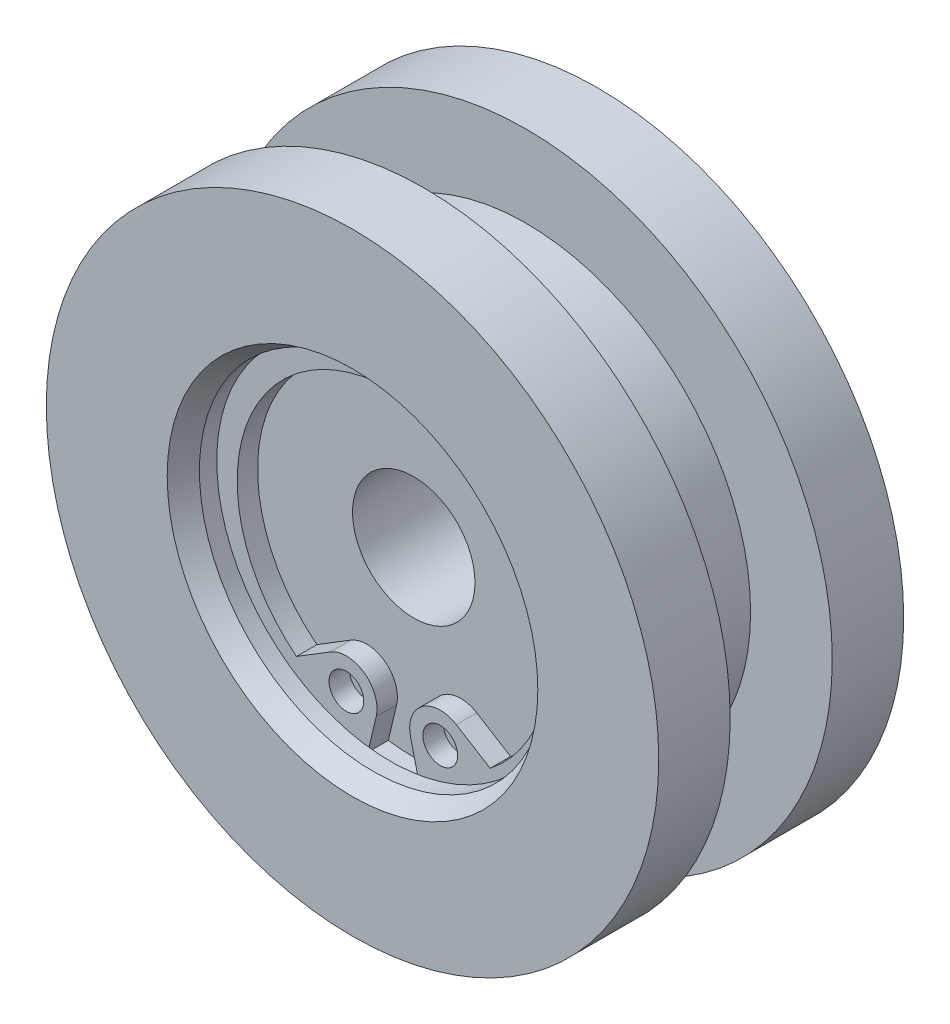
ISO-10303-21;
HEADER;
FILE_DESCRIPTION(('STEP AP214'),'2;1');
FILE_NAME('part.step','',(''),(''),'','','');
FILE_SCHEMA(('AUTOMOTIVE_DESIGN { 1 0 10303 214 1 1 1 1 }'));
ENDSEC;
DATA;
#1=APPLICATION_CONTEXT('core data for automotive mechanical design processes');
#2=APPLICATION_PROTOCOL_DEFINITION('international standard','automotive_design',2000,#1);
#3=PRODUCT_CONTEXT('',#1,'mechanical');
#4=PRODUCT('Part','Part','',(#3));
#5=PRODUCT_RELATED_PRODUCT_CATEGORY('part','',(#4));
#6=PRODUCT_DEFINITION_FORMATION('','',#4);
#7=PRODUCT_DEFINITION_CONTEXT('part definition',#1,'design');
#8=PRODUCT_DEFINITION('design','',#6,#7);
#9=PRODUCT_DEFINITION_SHAPE('','',#8);
#10=(LENGTH_UNIT() NAMED_UNIT(*) SI_UNIT(.MILLI.,.METRE.));
#11=(NAMED_UNIT(*) PLANE_ANGLE_UNIT() SI_UNIT($,.RADIAN.));
#12=(NAMED_UNIT(*) SI_UNIT($,.STERADIAN.) SOLID_ANGLE_UNIT());
#13=UNCERTAINTY_MEASURE_WITH_UNIT(LENGTH_MEASURE(1.E-05),#10,'distance_accuracy_value','');
#14=(GEOMETRIC_REPRESENTATION_CONTEXT(3) GLOBAL_UNCERTAINTY_ASSIGNED_CONTEXT((#13)) GLOBAL_UNIT_ASSIGNED_CONTEXT((#10,
#11,#12)) REPRESENTATION_CONTEXT('',''));
#15=CARTESIAN_POINT('',(0.,0.,0.));
#16=DIRECTION('',(0.,0.,1.));
#17=DIRECTION('',(1.,0.,0.));
#18=AXIS2_PLACEMENT_3D('',#15,#16,#17);
#19=CARTESIAN_POINT('',(0.,-0.5,4.));
#20=DIRECTION('',(0.,0.,1.));
#21=DIRECTION('',(-1.,0.,0.));
#22=AXIS2_PLACEMENT_3D('',#19,#20,#21);
#23=CYLINDRICAL_SURFACE('',#22,7.65);
#24=CARTESIAN_POINT('',(0.,-0.5,3.));
#25=DIRECTION('',(0.,0.,-1.));
#26=DIRECTION('',(0.,-1.,0.));
#27=AXIS2_PLACEMENT_3D('',#24,#25,#26);
#28=CIRCLE('',#27,7.65);
#29=CARTESIAN_POINT('',(-4.74513893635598,-6.50051301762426,3.));
#30=VERTEX_POINT('',#29);
#31=CARTESIAN_POINT('',(4.74513893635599,-6.50051301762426,3.));
#32=VERTEX_POINT('',#31);
#33=EDGE_CURVE('E110',#30,#32,#28,.T.);
#34=ORIENTED_EDGE('',*,*,#33,.T.);
#35=DIRECTION('',(0.,0.,-1.));
#36=VECTOR('',#35,1.);
#37=CARTESIAN_POINT('',(4.74513893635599,-6.50051301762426,4.));
#38=LINE('',#37,#36);
#39=CARTESIAN_POINT('',(4.74513893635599,-6.50051301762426,4.));
#40=VERTEX_POINT('',#39);
#41=EDGE_CURVE('E136',#40,#32,#38,.T.);
#42=ORIENTED_EDGE('',*,*,#41,.F.);
#43=CARTESIAN_POINT('',(0.,-0.5,4.));
#44=DIRECTION('',(0.,0.,-1.));
#45=DIRECTION('',(0.,-1.,0.));
#46=AXIS2_PLACEMENT_3D('',#43,#44,#45);
#47=CIRCLE('',#46,7.65);
#48=CARTESIAN_POINT('',(-4.74513893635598,-6.50051301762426,4.));
#49=VERTEX_POINT('',#48);
#50=EDGE_CURVE('E137',#49,#40,#47,.T.);
#51=ORIENTED_EDGE('',*,*,#50,.F.);
#52=DIRECTION('',(0.,0.,-1.));
#53=VECTOR('',#52,1.);
#54=CARTESIAN_POINT('',(-4.74513893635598,-6.50051301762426,4.));
#55=LINE('',#54,#53);
#56=EDGE_CURVE('E165',#49,#30,#55,.T.);
#57=ORIENTED_EDGE('',*,*,#56,.T.);
#58=EDGE_LOOP('',(#34,#42,#51,#57));
#59=FACE_BOUND('',#58,.T.);
#60=ADVANCED_FACE('F14',(#59),#23,.F.);
#61=CARTESIAN_POINT('',(3.08650226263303,-5.47917588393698,4.));
#62=DIRECTION('',(-0.524334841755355,-0.851512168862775,0.));
#63=DIRECTION('',(-0.851512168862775,0.524334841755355,0.));
#64=AXIS2_PLACEMENT_3D('',#61,#62,#63);
#65=PLANE('',#64);
#66=DIRECTION('',(-0.851512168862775,0.524334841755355,0.));
#67=VECTOR('',#66,1.);
#68=CARTESIAN_POINT('',(3.08650226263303,-5.47917588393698,3.));
#69=LINE('',#68,#67);
#70=CARTESIAN_POINT('',(3.08650226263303,-5.47917588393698,3.));
#71=VERTEX_POINT('',#70);
#72=EDGE_CURVE('E150',#32,#71,#69,.T.);
#73=ORIENTED_EDGE('',*,*,#72,.T.);
#74=DIRECTION('',(0.,0.,-1.));
#75=VECTOR('',#74,1.);
#76=CARTESIAN_POINT('',(3.08650226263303,-5.47917588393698,4.));
#77=LINE('',#76,#75);
#78=CARTESIAN_POINT('',(3.08650226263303,-5.47917588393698,4.));
#79=VERTEX_POINT('',#78);
#80=EDGE_CURVE('E145',#79,#71,#77,.T.);
#81=ORIENTED_EDGE('',*,*,#80,.F.);
#82=DIRECTION('',(-0.851512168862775,0.524334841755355,0.));
#83=VECTOR('',#82,1.);
#84=CARTESIAN_POINT('',(3.08650226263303,-5.47917588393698,4.));
#85=LINE('',#84,#83);
#86=EDGE_CURVE('E155',#40,#79,#85,.T.);
#87=ORIENTED_EDGE('',*,*,#86,.F.);
#88=ORIENTED_EDGE('',*,*,#41,.T.);
#89=EDGE_LOOP('',(#73,#81,#87,#88));
#90=FACE_BOUND('',#89,.T.);
#91=ADVANCED_FACE('F298',(#90),#65,.F.);
#92=CARTESIAN_POINT('',(2.3,-6.75644413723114,4.));
#93=DIRECTION('',(0.,0.,1.));
#94=DIRECTION('',(-1.,0.,0.));
#95=AXIS2_PLACEMENT_3D('',#92,#93,#94);
#96=CYLINDRICAL_SURFACE('',#95,1.5);
#97=CARTESIAN_POINT('',(2.3,-6.75644413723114,3.));
#98=DIRECTION('',(0.,0.,1.));
#99=DIRECTION('',(1.,0.,0.));
#100=AXIS2_PLACEMENT_3D('',#97,#98,#99);
#101=CIRCLE('',#100,1.5);
#102=CARTESIAN_POINT('',(0.840693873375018,-7.10346809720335,3.));
#103=VERTEX_POINT('',#102);
#104=EDGE_CURVE('E160',#71,#103,#101,.T.);
#105=ORIENTED_EDGE('',*,*,#104,.T.);
#106=DIRECTION('',(0.,0.,-1.));
#107=VECTOR('',#106,1.);
#108=CARTESIAN_POINT('',(0.840693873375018,-7.10346809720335,4.));
#109=LINE('',#108,#107);
#110=CARTESIAN_POINT('',(0.840693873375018,-7.10346809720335,4.));
#111=VERTEX_POINT('',#110);
#112=EDGE_CURVE('E146',#111,#103,#109,.T.);
#113=ORIENTED_EDGE('',*,*,#112,.F.);
#114=CARTESIAN_POINT('',(2.3,-6.75644413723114,4.));
#115=DIRECTION('',(0.,0.,1.));
#116=DIRECTION('',(1.,0.,0.));
#117=AXIS2_PLACEMENT_3D('',#114,#115,#116);
#118=CIRCLE('',#117,1.5);
#119=EDGE_CURVE('E151',#79,#111,#118,.T.);
#120=ORIENTED_EDGE('',*,*,#119,.F.);
#121=ORIENTED_EDGE('',*,*,#80,.T.);
#122=EDGE_LOOP('',(#105,#113,#120,#121));
#123=FACE_BOUND('',#122,.T.);
#124=ADVANCED_FACE('F244',(#123),#96,.T.);
#125=CARTESIAN_POINT('',(-0.84069387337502,-7.10346809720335,4.));
#126=DIRECTION('',(-0.97287075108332,0.231349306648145,0.));
#127=DIRECTION('',(0.,0.,1.));
#128=AXIS2_PLACEMENT_3D('',#125,#126,#127);
#129=PLANE('',#128);
#130=DIRECTION('',(0.,0.,1.));
#131=VECTOR('',#130,1.);
#132=CARTESIAN_POINT('',(-1.24703201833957,-8.81220240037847,8.6342229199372));
#133=LINE('',#132,#131);
#134=CARTESIAN_POINT('',(-1.24703201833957,-8.81220240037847,3.));
#135=VERTEX_POINT('',#134);
#136=CARTESIAN_POINT('',(-1.24703201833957,-8.81220240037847,4.));
#137=VERTEX_POINT('',#136);
#138=EDGE_CURVE('E115',#135,#137,#133,.T.);
#139=ORIENTED_EDGE('',*,*,#138,.F.);
#140=DIRECTION('',(0.231349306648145,0.97287075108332,0.));
#141=VECTOR('',#140,1.);
#142=CARTESIAN_POINT('',(-0.84069387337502,-7.10346809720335,3.));
#143=LINE('',#142,#141);
#144=CARTESIAN_POINT('',(-0.84069387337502,-7.10346809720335,3.));
#145=VERTEX_POINT('',#144);
#146=EDGE_CURVE('E103',#135,#145,#143,.T.);
#147=ORIENTED_EDGE('',*,*,#146,.T.);
#148=DIRECTION('',(0.,0.,-1.));
#149=VECTOR('',#148,1.);
#150=CARTESIAN_POINT('',(-0.84069387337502,-7.10346809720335,4.));
#151=LINE('',#150,#149);
#152=CARTESIAN_POINT('',(-0.84069387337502,-7.10346809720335,4.));
#153=VERTEX_POINT('',#152);
#154=EDGE_CURVE('E99',#153,#145,#151,.T.);
#155=ORIENTED_EDGE('',*,*,#154,.F.);
#156=DIRECTION('',(0.231349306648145,0.97287075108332,0.));
#157=VECTOR('',#156,1.);
#158=CARTESIAN_POINT('',(-0.84069387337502,-7.10346809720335,4.));
#159=LINE('',#158,#157);
#160=EDGE_CURVE('E141',#137,#153,#159,.T.);
#161=ORIENTED_EDGE('',*,*,#160,.F.);
#162=EDGE_LOOP('',(#139,#147,#155,#161));
#163=FACE_BOUND('',#162,.T.);
#164=ADVANCED_FACE('F265',(#163),#129,.F.);
#165=CARTESIAN_POINT('',(0.,-0.5,4.));
#166=DIRECTION('',(0.,0.,-1.));
#167=DIRECTION('',(0.,-1.,0.));
#168=AXIS2_PLACEMENT_3D('',#165,#166,#167);
#169=PLANE('',#168);
#170=CARTESIAN_POINT('',(2.3,-6.75644413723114,4.));
#171=DIRECTION('',(0.,0.,1.));
#172=DIRECTION('',(1.,0.,0.));
#173=AXIS2_PLACEMENT_3D('',#170,#171,#172);
#174=CIRCLE('',#173,0.85);
#175=CARTESIAN_POINT('',(3.15,-6.75644413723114,4.));
#176=VERTEX_POINT('',#175);
#177=EDGE_CURVE('E130',#176,#176,#174,.T.);
#178=ORIENTED_EDGE('',*,*,#177,.F.);
#179=EDGE_LOOP('',(#178));
#180=FACE_BOUND('',#179,.T.);
#181=CARTESIAN_POINT('',(-2.3,-6.75644413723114,4.));
#182=DIRECTION('',(0.,0.,-1.));
#183=DIRECTION('',(1.,0.,0.));
#184=AXIS2_PLACEMENT_3D('',#181,#182,#183);
#185=CIRCLE('',#184,0.85);
#186=CARTESIAN_POINT('',(-1.45,-6.75644413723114,4.));
#187=VERTEX_POINT('',#186);
#188=EDGE_CURVE('E142',#187,#187,#185,.T.);
#189=ORIENTED_EDGE('',*,*,#188,.T.);
#190=EDGE_LOOP('',(#189));
#191=FACE_BOUND('',#190,.T.);
#192=CARTESIAN_POINT('',(0.,0.,4.));
#193=DIRECTION('',(0.,0.,-1.));
#194=DIRECTION('',(-1.,0.,0.));
#195=AXIS2_PLACEMENT_3D('',#192,#193,#194);
#196=CIRCLE('',#195,8.9);
#197=CARTESIAN_POINT('',(1.24703201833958,-8.81220240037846,4.));
#198=VERTEX_POINT('',#197);
#199=EDGE_CURVE('E9',#137,#198,#196,.T.);
#200=ORIENTED_EDGE('',*,*,#199,.F.);
#201=ORIENTED_EDGE('',*,*,#160,.T.);
#202=CARTESIAN_POINT('',(-2.3,-6.75644413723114,4.));
#203=DIRECTION('',(0.,0.,1.));
#204=DIRECTION('',(-1.,0.,0.));
#205=AXIS2_PLACEMENT_3D('',#202,#203,#204);
#206=CIRCLE('',#205,1.5);
#207=CARTESIAN_POINT('',(-3.08650226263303,-5.47917588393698,4.));
#208=VERTEX_POINT('',#207);
#209=EDGE_CURVE('E138',#153,#208,#206,.T.);
#210=ORIENTED_EDGE('',*,*,#209,.T.);
#211=DIRECTION('',(-0.851512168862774,-0.524334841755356,0.));
#212=VECTOR('',#211,1.);
#213=CARTESIAN_POINT('',(-3.08650226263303,-5.47917588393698,4.));
#214=LINE('',#213,#212);
#215=EDGE_CURVE('E118',#208,#49,#214,.T.);
#216=ORIENTED_EDGE('',*,*,#215,.T.);
#217=ORIENTED_EDGE('',*,*,#50,.T.);
#218=ORIENTED_EDGE('',*,*,#86,.T.);
#219=ORIENTED_EDGE('',*,*,#119,.T.);
#220=DIRECTION('',(0.231349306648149,-0.972870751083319,0.));
#221=VECTOR('',#220,1.);
#222=CARTESIAN_POINT('',(0.840693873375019,-7.10346809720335,4.));
#223=LINE('',#222,#221);
#224=EDGE_CURVE('E156',#111,#198,#223,.T.);
#225=ORIENTED_EDGE('',*,*,#224,.T.);
#226=EDGE_LOOP('',(#200,#201,#210,#216,#217,#218,#219,#225));
#227=FACE_BOUND('',#226,.T.);
#228=ADVANCED_FACE('F261',(#180,#191,#227),#169,.F.);
#229=CARTESIAN_POINT('',(2.3,-6.75644413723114,4.));
#230=DIRECTION('',(0.,0.,1.));
#231=DIRECTION('',(-1.,0.,0.));
#232=AXIS2_PLACEMENT_3D('',#229,#230,#231);
#233=CYLINDRICAL_SURFACE('',#232,0.85);
#234=CARTESIAN_POINT('',(2.3,-6.75644413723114,3.));
#235=DIRECTION('',(0.,0.,1.));
#236=DIRECTION('',(1.,0.,0.));
#237=AXIS2_PLACEMENT_3D('',#234,#235,#236);
#238=CIRCLE('',#237,0.85);
#239=CARTESIAN_POINT('',(3.15,-6.75644413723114,3.));
#240=VERTEX_POINT('',#239);
#241=EDGE_CURVE('E120',#240,#240,#238,.T.);
#242=ORIENTED_EDGE('',*,*,#241,.F.);
#243=EDGE_LOOP('',(#242));
#244=FACE_BOUND('',#243,.T.);
#245=ORIENTED_EDGE('',*,*,#177,.T.);
#246=EDGE_LOOP('',(#245));
#247=FACE_BOUND('',#246,.T.);
#248=ADVANCED_FACE('F310',(#244,#247),#233,.F.);
#249=CARTESIAN_POINT('',(-2.3,-6.75644413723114,4.));
#250=DIRECTION('',(0.,0.,1.));
#251=DIRECTION('',(-1.,0.,0.));
#252=AXIS2_PLACEMENT_3D('',#249,#250,#251);
#253=CYLINDRICAL_SURFACE('',#252,0.85);
#254=CARTESIAN_POINT('',(-2.3,-6.75644413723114,3.));
#255=DIRECTION('',(0.,0.,-1.));
#256=DIRECTION('',(1.,0.,0.));
#257=AXIS2_PLACEMENT_3D('',#254,#255,#256);
#258=CIRCLE('',#257,0.85);
#259=CARTESIAN_POINT('',(-1.45,-6.75644413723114,3.));
#260=VERTEX_POINT('',#259);
#261=EDGE_CURVE('E133',#260,#260,#258,.T.);
#262=ORIENTED_EDGE('',*,*,#261,.T.);
#263=EDGE_LOOP('',(#262));
#264=FACE_BOUND('',#263,.T.);
#265=ORIENTED_EDGE('',*,*,#188,.F.);
#266=EDGE_LOOP('',(#265));
#267=FACE_BOUND('',#266,.T.);
#268=ADVANCED_FACE('F492',(#264,#267),#253,.F.);
#269=CARTESIAN_POINT('',(-3.08650226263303,-5.47917588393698,4.));
#270=DIRECTION('',(0.524334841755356,-0.851512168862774,0.));
#271=DIRECTION('',(0.,0.,-1.));
#272=AXIS2_PLACEMENT_3D('',#269,#270,#271);
#273=PLANE('',#272);
#274=DIRECTION('',(-0.851512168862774,-0.524334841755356,0.));
#275=VECTOR('',#274,1.);
#276=CARTESIAN_POINT('',(-3.08650226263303,-5.47917588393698,3.));
#277=LINE('',#276,#275);
#278=CARTESIAN_POINT('',(-3.08650226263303,-5.47917588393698,3.));
#279=VERTEX_POINT('',#278);
#280=EDGE_CURVE('E106',#279,#30,#277,.T.);
#281=ORIENTED_EDGE('',*,*,#280,.T.);
#282=ORIENTED_EDGE('',*,*,#56,.F.);
#283=ORIENTED_EDGE('',*,*,#215,.F.);
#284=DIRECTION('',(0.,0.,-1.));
#285=VECTOR('',#284,1.);
#286=CARTESIAN_POINT('',(-3.08650226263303,-5.47917588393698,4.));
#287=LINE('',#286,#285);
#288=EDGE_CURVE('E96',#208,#279,#287,.T.);
#289=ORIENTED_EDGE('',*,*,#288,.T.);
#290=EDGE_LOOP('',(#281,#282,#283,#289));
#291=FACE_BOUND('',#290,.T.);
#292=ADVANCED_FACE('F117',(#291),#273,.F.);
#293=CARTESIAN_POINT('',(-2.3,-6.75644413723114,4.));
#294=DIRECTION('',(0.,0.,1.));
#295=DIRECTION('',(-1.,0.,0.));
#296=AXIS2_PLACEMENT_3D('',#293,#294,#295);
#297=CYLINDRICAL_SURFACE('',#296,1.5);
#298=CARTESIAN_POINT('',(-2.3,-6.75644413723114,3.));
#299=DIRECTION('',(0.,0.,1.));
#300=DIRECTION('',(-1.,0.,0.));
#301=AXIS2_PLACEMENT_3D('',#298,#299,#300);
#302=CIRCLE('',#301,1.5);
#303=EDGE_CURVE('E91',#145,#279,#302,.T.);
#304=ORIENTED_EDGE('',*,*,#303,.T.);
#305=ORIENTED_EDGE('',*,*,#288,.F.);
#306=ORIENTED_EDGE('',*,*,#209,.F.);
#307=ORIENTED_EDGE('',*,*,#154,.T.);
#308=EDGE_LOOP('',(#304,#305,#306,#307));
#309=FACE_BOUND('',#308,.T.);
#310=ADVANCED_FACE('F93',(#309),#297,.T.);
#311=CARTESIAN_POINT('',(0.840693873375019,-7.10346809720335,4.));
#312=DIRECTION('',(0.972870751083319,0.231349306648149,0.));
#313=DIRECTION('',(0.,0.,-1.));
#314=AXIS2_PLACEMENT_3D('',#311,#312,#313);
#315=PLANE('',#314);
#316=DIRECTION('',(0.,0.,1.));
#317=VECTOR('',#316,1.);
#318=CARTESIAN_POINT('',(1.24703201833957,-8.81220240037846,8.6342229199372));
#319=LINE('',#318,#317);
#320=CARTESIAN_POINT('',(1.24703201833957,-8.81220240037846,3.));
#321=VERTEX_POINT('',#320);
#322=EDGE_CURVE('E18',#198,#321,#319,.F.);
#323=ORIENTED_EDGE('',*,*,#322,.F.);
#324=ORIENTED_EDGE('',*,*,#224,.F.);
#325=ORIENTED_EDGE('',*,*,#112,.T.);
#326=DIRECTION('',(0.231349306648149,-0.972870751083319,0.));
#327=VECTOR('',#326,1.);
#328=CARTESIAN_POINT('',(0.840693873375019,-7.10346809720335,3.));
#329=LINE('',#328,#327);
#330=EDGE_CURVE('E32',#103,#321,#329,.T.);
#331=ORIENTED_EDGE('',*,*,#330,.T.);
#332=EDGE_LOOP('',(#323,#324,#325,#331));
#333=FACE_BOUND('',#332,.T.);
#334=ADVANCED_FACE('F247',(#333),#315,.F.);
#335=CARTESIAN_POINT('',(0.,3.,3.));
#336=DIRECTION('',(0.,0.,-1.));
#337=DIRECTION('',(-1.,0.,0.));
#338=AXIS2_PLACEMENT_3D('',#335,#336,#337);
#339=PLANE('',#338);
#340=ORIENTED_EDGE('',*,*,#241,.T.);
#341=EDGE_LOOP('',(#340));
#342=FACE_BOUND('',#341,.T.);
#343=ADVANCED_FACE('F284',(#342),#339,.F.);
#344=ORIENTED_EDGE('',*,*,#261,.F.);
#345=EDGE_LOOP('',(#344));
#346=FACE_BOUND('',#345,.T.);
#347=ADVANCED_FACE('F286',(#346),#339,.F.);
#348=CARTESIAN_POINT('',(0.,0.,8.6342229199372));
#349=DIRECTION('',(0.,0.,1.));
#350=DIRECTION('',(1.,0.,0.));
#351=AXIS2_PLACEMENT_3D('',#348,#349,#350);
#352=CYLINDRICAL_SURFACE('',#351,11.);
#353=CARTESIAN_POINT('',(0.,0.,2.5));
#354=DIRECTION('',(0.,0.,1.));
#355=DIRECTION('',(1.,0.,0.));
#356=AXIS2_PLACEMENT_3D('',#353,#354,#355);
#357=CIRCLE('',#356,11.);
#358=CARTESIAN_POINT('',(11.,0.,2.5));
#359=VERTEX_POINT('',#358);
#360=EDGE_CURVE('E207',#359,#359,#357,.T.);
#361=ORIENTED_EDGE('',*,*,#360,.F.);
#362=EDGE_LOOP('',(#361));
#363=FACE_BOUND('',#362,.T.);
#364=CARTESIAN_POINT('',(0.,0.,-2.5));
#365=DIRECTION('',(0.,0.,1.));
#366=DIRECTION('',(1.,0.,0.));
#367=AXIS2_PLACEMENT_3D('',#364,#365,#366);
#368=CIRCLE('',#367,11.);
#369=CARTESIAN_POINT('',(11.,0.,-2.5));
#370=VERTEX_POINT('',#369);
#371=EDGE_CURVE('E210',#370,#370,#368,.T.);
#372=ORIENTED_EDGE('',*,*,#371,.T.);
#373=EDGE_LOOP('',(#372));
#374=FACE_BOUND('',#373,.T.);
#375=ADVANCED_FACE('F292',(#363,#374),#352,.T.);
#376=CARTESIAN_POINT('',(0.,11.,2.5));
#377=DIRECTION('',(0.,0.,1.));
#378=DIRECTION('',(1.,0.,0.));
#379=AXIS2_PLACEMENT_3D('',#376,#377,#378);
#380=PLANE('',#379);
#381=CARTESIAN_POINT('',(0.,0.,2.5));
#382=DIRECTION('',(0.,0.,1.));
#383=DIRECTION('',(1.,0.,0.));
#384=AXIS2_PLACEMENT_3D('',#381,#382,#383);
#385=CIRCLE('',#384,15.);
#386=CARTESIAN_POINT('',(15.,0.,2.5));
#387=VERTEX_POINT('',#386);
#388=EDGE_CURVE('E204',#387,#387,#385,.T.);
#389=ORIENTED_EDGE('',*,*,#388,.F.);
#390=EDGE_LOOP('',(#389));
#391=FACE_BOUND('',#390,.T.);
#392=ORIENTED_EDGE('',*,*,#360,.T.);
#393=EDGE_LOOP('',(#392));
#394=FACE_BOUND('',#393,.T.);
#395=ADVANCED_FACE('F354',(#391,#394),#380,.F.);
#396=CARTESIAN_POINT('',(0.,15.,-2.5));
#397=DIRECTION('',(0.,0.,-1.));
#398=DIRECTION('',(-1.,0.,0.));
#399=AXIS2_PLACEMENT_3D('',#396,#397,#398);
#400=PLANE('',#399);
#401=ORIENTED_EDGE('',*,*,#371,.F.);
#402=EDGE_LOOP('',(#401));
#403=FACE_BOUND('',#402,.T.);
#404=CARTESIAN_POINT('',(0.,0.,-2.5));
#405=DIRECTION('',(0.,0.,1.));
#406=DIRECTION('',(1.,0.,0.));
#407=AXIS2_PLACEMENT_3D('',#404,#405,#406);
#408=CIRCLE('',#407,15.);
#409=CARTESIAN_POINT('',(15.,0.,-2.5));
#410=VERTEX_POINT('',#409);
#411=EDGE_CURVE('E213',#410,#410,#408,.T.);
#412=ORIENTED_EDGE('',*,*,#411,.T.);
#413=EDGE_LOOP('',(#412));
#414=FACE_BOUND('',#413,.T.);
#415=ADVANCED_FACE('F352',(#403,#414),#400,.F.);
#416=CARTESIAN_POINT('',(0.,0.,8.6342229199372));
#417=DIRECTION('',(0.,0.,1.));
#418=DIRECTION('',(1.,0.,0.));
#419=AXIS2_PLACEMENT_3D('',#416,#417,#418);
#420=CYLINDRICAL_SURFACE('',#419,15.);
#421=CARTESIAN_POINT('',(0.,0.,6.));
#422=DIRECTION('',(0.,0.,1.));
#423=DIRECTION('',(1.,0.,0.));
#424=AXIS2_PLACEMENT_3D('',#421,#422,#423);
#425=CIRCLE('',#424,15.);
#426=CARTESIAN_POINT('',(15.,0.,6.));
#427=VERTEX_POINT('',#426);
#428=EDGE_CURVE('E201',#427,#427,#425,.T.);
#429=ORIENTED_EDGE('',*,*,#428,.F.);
#430=EDGE_LOOP('',(#429));
#431=FACE_BOUND('',#430,.T.);
#432=ORIENTED_EDGE('',*,*,#388,.T.);
#433=EDGE_LOOP('',(#432));
#434=FACE_BOUND('',#433,.T.);
#435=ADVANCED_FACE('F349',(#431,#434),#420,.T.);
#436=CARTESIAN_POINT('',(0.,0.,8.6342229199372));
#437=DIRECTION('',(0.,0.,1.));
#438=DIRECTION('',(1.,0.,0.));
#439=AXIS2_PLACEMENT_3D('',#436,#437,#438);
#440=CYLINDRICAL_SURFACE('',#439,15.);
#441=ORIENTED_EDGE('',*,*,#411,.F.);
#442=EDGE_LOOP('',(#441));
#443=FACE_BOUND('',#442,.T.);
#444=CARTESIAN_POINT('',(0.,0.,-6.));
#445=DIRECTION('',(0.,0.,1.));
#446=DIRECTION('',(1.,0.,0.));
#447=AXIS2_PLACEMENT_3D('',#444,#445,#446);
#448=CIRCLE('',#447,15.);
#449=CARTESIAN_POINT('',(15.,0.,-6.));
#450=VERTEX_POINT('',#449);
#451=EDGE_CURVE('E172',#450,#450,#448,.T.);
#452=ORIENTED_EDGE('',*,*,#451,.T.);
#453=EDGE_LOOP('',(#452));
#454=FACE_BOUND('',#453,.T.);
#455=ADVANCED_FACE('F16',(#443,#454),#440,.T.);
#456=CARTESIAN_POINT('',(0.,15.,6.));
#457=DIRECTION('',(0.,0.,-1.));
#458=DIRECTION('',(-1.,0.,0.));
#459=AXIS2_PLACEMENT_3D('',#456,#457,#458);
#460=PLANE('',#459);
#461=CARTESIAN_POINT('',(0.,0.,6.));
#462=DIRECTION('',(0.,0.,1.));
#463=DIRECTION('',(1.,0.,0.));
#464=AXIS2_PLACEMENT_3D('',#461,#462,#463);
#465=CIRCLE('',#464,9.07735026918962);
#466=CARTESIAN_POINT('',(9.07735026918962,0.,6.));
#467=VERTEX_POINT('',#466);
#468=EDGE_CURVE('E198',#467,#467,#465,.T.);
#469=ORIENTED_EDGE('',*,*,#468,.F.);
#470=EDGE_LOOP('',(#469));
#471=FACE_BOUND('',#470,.T.);
#472=ORIENTED_EDGE('',*,*,#428,.T.);
#473=EDGE_LOOP('',(#472));
#474=FACE_BOUND('',#473,.T.);
#475=ADVANCED_FACE('F318',(#471,#474),#460,.F.);
#476=CARTESIAN_POINT('',(0.,6.5,-6.));
#477=DIRECTION('',(0.,0.,1.));
#478=DIRECTION('',(1.,0.,0.));
#479=AXIS2_PLACEMENT_3D('',#476,#477,#478);
#480=PLANE('',#479);
#481=ORIENTED_EDGE('',*,*,#451,.F.);
#482=EDGE_LOOP('',(#481));
#483=FACE_BOUND('',#482,.T.);
#484=CARTESIAN_POINT('',(0.,0.,-6.));
#485=DIRECTION('',(0.,0.,1.));
#486=DIRECTION('',(1.,0.,0.));
#487=AXIS2_PLACEMENT_3D('',#484,#485,#486);
#488=CIRCLE('',#487,6.5);
#489=CARTESIAN_POINT('',(6.5,0.,-6.));
#490=VERTEX_POINT('',#489);
#491=EDGE_CURVE('E175',#490,#490,#488,.T.);
#492=ORIENTED_EDGE('',*,*,#491,.T.);
#493=EDGE_LOOP('',(#492));
#494=FACE_BOUND('',#493,.T.);
#495=ADVANCED_FACE('F314',(#483,#494),#480,.F.);
#496=CARTESIAN_POINT('',(0.,0.,6.));
#497=DIRECTION('',(0.,0.,1.));
#498=DIRECTION('',(1.,0.,0.));
#499=AXIS2_PLACEMENT_3D('',#496,#497,#498);
#500=CONICAL_SURFACE('',#499,9.07735026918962,0.523598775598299);
#501=CARTESIAN_POINT('',(0.,0.,5.));
#502=DIRECTION('',(0.,0.,1.));
#503=DIRECTION('',(1.,0.,0.));
#504=AXIS2_PLACEMENT_3D('',#501,#502,#503);
#505=CIRCLE('',#504,8.5);
#506=CARTESIAN_POINT('',(8.5,0.,5.));
#507=VERTEX_POINT('',#506);
#508=EDGE_CURVE('E195',#507,#507,#505,.T.);
#509=ORIENTED_EDGE('',*,*,#508,.F.);
#510=EDGE_LOOP('',(#509));
#511=FACE_BOUND('',#510,.T.);
#512=ORIENTED_EDGE('',*,*,#468,.T.);
#513=EDGE_LOOP('',(#512));
#514=FACE_BOUND('',#513,.T.);
#515=ADVANCED_FACE('F317',(#511,#514),#500,.F.);
#516=CARTESIAN_POINT('',(0.,0.,8.6342229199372));
#517=DIRECTION('',(0.,0.,1.));
#518=DIRECTION('',(1.,0.,0.));
#519=AXIS2_PLACEMENT_3D('',#516,#517,#518);
#520=CYLINDRICAL_SURFACE('',#519,6.5);
#521=ORIENTED_EDGE('',*,*,#491,.F.);
#522=EDGE_LOOP('',(#521));
#523=FACE_BOUND('',#522,.T.);
#524=CARTESIAN_POINT('',(0.,0.,-3.));
#525=DIRECTION('',(0.,0.,1.));
#526=DIRECTION('',(1.,0.,0.));
#527=AXIS2_PLACEMENT_3D('',#524,#525,#526);
#528=CIRCLE('',#527,6.5);
#529=CARTESIAN_POINT('',(6.5,0.,-3.));
#530=VERTEX_POINT('',#529);
#531=EDGE_CURVE('E178',#530,#530,#528,.T.);
#532=ORIENTED_EDGE('',*,*,#531,.T.);
#533=EDGE_LOOP('',(#532));
#534=FACE_BOUND('',#533,.T.);
#535=ADVANCED_FACE('F320',(#523,#534),#520,.F.);
#536=CARTESIAN_POINT('',(0.,0.,8.6342229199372));
#537=DIRECTION('',(0.,0.,1.));
#538=DIRECTION('',(1.,0.,0.));
#539=AXIS2_PLACEMENT_3D('',#536,#537,#538);
#540=CYLINDRICAL_SURFACE('',#539,8.5);
#541=CARTESIAN_POINT('',(0.,0.,4.15));
#542=DIRECTION('',(0.,0.,1.));
#543=DIRECTION('',(1.,0.,0.));
#544=AXIS2_PLACEMENT_3D('',#541,#542,#543);
#545=CIRCLE('',#544,8.5);
#546=CARTESIAN_POINT('',(8.5,0.,4.15));
#547=VERTEX_POINT('',#546);
#548=EDGE_CURVE('E192',#547,#547,#545,.T.);
#549=ORIENTED_EDGE('',*,*,#548,.F.);
#550=EDGE_LOOP('',(#549));
#551=FACE_BOUND('',#550,.T.);
#552=ORIENTED_EDGE('',*,*,#508,.T.);
#553=EDGE_LOOP('',(#552));
#554=FACE_BOUND('',#553,.T.);
#555=ADVANCED_FACE('F323',(#551,#554),#540,.F.);
#556=CARTESIAN_POINT('',(0.,6.5,-3.));
#557=DIRECTION('',(0.,0.,1.));
#558=DIRECTION('',(1.,0.,0.));
#559=AXIS2_PLACEMENT_3D('',#556,#557,#558);
#560=PLANE('',#559);
#561=ORIENTED_EDGE('',*,*,#531,.F.);
#562=EDGE_LOOP('',(#561));
#563=FACE_BOUND('',#562,.T.);
#564=CARTESIAN_POINT('',(0.,0.,-3.));
#565=DIRECTION('',(0.,0.,1.));
#566=DIRECTION('',(1.,0.,0.));
#567=AXIS2_PLACEMENT_3D('',#564,#565,#566);
#568=CIRCLE('',#567,3.);
#569=CARTESIAN_POINT('',(3.,0.,-3.));
#570=VERTEX_POINT('',#569);
#571=EDGE_CURVE('E181',#570,#570,#568,.T.);
#572=ORIENTED_EDGE('',*,*,#571,.T.);
#573=EDGE_LOOP('',(#572));
#574=FACE_BOUND('',#573,.T.);
#575=ADVANCED_FACE('F280',(#563,#574),#560,.F.);
#576=CARTESIAN_POINT('',(0.,8.9,4.15));
#577=DIRECTION('',(0.,0.,1.));
#578=DIRECTION('',(1.,0.,0.));
#579=AXIS2_PLACEMENT_3D('',#576,#577,#578);
#580=PLANE('',#579);
#581=CARTESIAN_POINT('',(0.,0.,4.15));
#582=DIRECTION('',(0.,0.,1.));
#583=DIRECTION('',(1.,0.,0.));
#584=AXIS2_PLACEMENT_3D('',#581,#582,#583);
#585=CIRCLE('',#584,8.9);
#586=CARTESIAN_POINT('',(8.9,0.,4.15));
#587=VERTEX_POINT('',#586);
#588=EDGE_CURVE('E189',#587,#587,#585,.T.);
#589=ORIENTED_EDGE('',*,*,#588,.F.);
#590=EDGE_LOOP('',(#589));
#591=FACE_BOUND('',#590,.T.);
#592=ORIENTED_EDGE('',*,*,#548,.T.);
#593=EDGE_LOOP('',(#592));
#594=FACE_BOUND('',#593,.T.);
#595=ADVANCED_FACE('F270',(#591,#594),#580,.F.);
#596=CARTESIAN_POINT('',(0.,0.,8.6342229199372));
#597=DIRECTION('',(0.,0.,1.));
#598=DIRECTION('',(1.,0.,0.));
#599=AXIS2_PLACEMENT_3D('',#596,#597,#598);
#600=CYLINDRICAL_SURFACE('',#599,8.9);
#601=ORIENTED_EDGE('',*,*,#588,.T.);
#602=EDGE_LOOP('',(#601));
#603=FACE_BOUND('',#602,.T.);
#604=ORIENTED_EDGE('',*,*,#199,.T.);
#605=ORIENTED_EDGE('',*,*,#322,.T.);
#606=CARTESIAN_POINT('',(0.,0.,3.));
#607=DIRECTION('',(0.,0.,1.));
#608=DIRECTION('',(1.,0.,0.));
#609=AXIS2_PLACEMENT_3D('',#606,#607,#608);
#610=CIRCLE('',#609,8.9);
#611=EDGE_CURVE('E187',#135,#321,#610,.T.);
#612=ORIENTED_EDGE('',*,*,#611,.F.);
#613=ORIENTED_EDGE('',*,*,#138,.T.);
#614=EDGE_LOOP('',(#604,#605,#612,#613));
#615=FACE_BOUND('',#614,.T.);
#616=ADVANCED_FACE('F267',(#603,#615),#600,.F.);
#617=CARTESIAN_POINT('',(0.,0.,8.6342229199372));
#618=DIRECTION('',(0.,0.,1.));
#619=DIRECTION('',(1.,0.,0.));
#620=AXIS2_PLACEMENT_3D('',#617,#618,#619);
#621=CYLINDRICAL_SURFACE('',#620,3.);
#622=ORIENTED_EDGE('',*,*,#571,.F.);
#623=EDGE_LOOP('',(#622));
#624=FACE_BOUND('',#623,.T.);
#625=CARTESIAN_POINT('',(0.,0.,3.));
#626=DIRECTION('',(0.,0.,1.));
#627=DIRECTION('',(1.,0.,0.));
#628=AXIS2_PLACEMENT_3D('',#625,#626,#627);
#629=CIRCLE('',#628,3.);
#630=CARTESIAN_POINT('',(3.,0.,3.));
#631=VERTEX_POINT('',#630);
#632=EDGE_CURVE('E184',#631,#631,#629,.T.);
#633=ORIENTED_EDGE('',*,*,#632,.T.);
#634=EDGE_LOOP('',(#633));
#635=FACE_BOUND('',#634,.T.);
#636=ADVANCED_FACE('F269',(#624,#635),#621,.F.);
#637=ORIENTED_EDGE('',*,*,#632,.F.);
#638=EDGE_LOOP('',(#637));
#639=FACE_BOUND('',#638,.T.);
#640=ORIENTED_EDGE('',*,*,#611,.T.);
#641=ORIENTED_EDGE('',*,*,#330,.F.);
#642=ORIENTED_EDGE('',*,*,#104,.F.);
#643=ORIENTED_EDGE('',*,*,#72,.F.);
#644=ORIENTED_EDGE('',*,*,#33,.F.);
#645=ORIENTED_EDGE('',*,*,#280,.F.);
#646=ORIENTED_EDGE('',*,*,#303,.F.);
#647=ORIENTED_EDGE('',*,*,#146,.F.);
#648=EDGE_LOOP('',(#640,#641,#642,#643,#644,#645,#646,#647));
#649=FACE_BOUND('',#648,.T.);
#650=ADVANCED_FACE('F108',(#639,#649),#339,.F.);
#651=CLOSED_SHELL('',(#60,#91,#124,#164,#228,#248,#268,#292,#310,#334,#343,#347,#375,#395,#415,
#435,#455,#475,#495,#515,#535,#555,#575,#595,#616,#636,#650));
#652=MANIFOLD_SOLID_BREP('B1',#651);
#653=ADVANCED_BREP_SHAPE_REPRESENTATION('',(#18,#652),#14);
#654=SHAPE_DEFINITION_REPRESENTATION(#9,#653);
ENDSEC;
END-ISO-10303-21;
